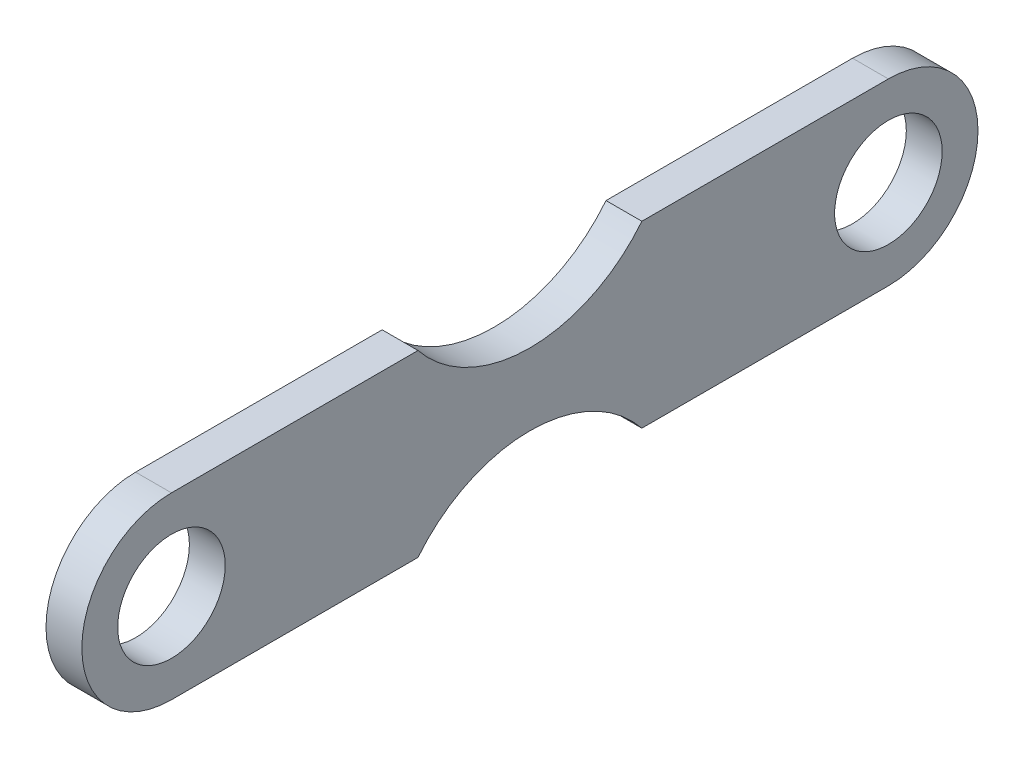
from build123d import *

# Parameters (mm, degrees)
SKETCH1_R           = 15
BOSS_EXTRUDE1_DEPTH = 10


with BuildPart() as part:
    # Sketch1 → Boss-Extrude1 (new body)
    with BuildSketch(Plane(origin=(0, 0, 0), x_dir=(0, 0, -1), z_dir=(1, 0, 0))):
        with BuildLine():
            Line((100, -25), (31.224989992, -25))
            ThreePointArc((31.224989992, -25), (0, -10), (-31.224989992, -25))
            Line((-31.224989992, -25), (-100, -25))
            ThreePointArc((-100, -25), (-125, 0), (-100, 25))
            Line((-100, 25), (-31.224989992, 25))
            ThreePointArc((-31.224989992, 25), (0, 10), (31.224989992, 25))
            Line((31.224989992, 25), (100, 25))
            ThreePointArc((100, 25), (125, 0), (100, -25))
        make_face()
        with Locations((-100, 0)):
            Circle(SKETCH1_R, mode=Mode.SUBTRACT)
        with Locations((100, 0)):
            Circle(SKETCH1_R, mode=Mode.SUBTRACT)
    extrude(amount=BOSS_EXTRUDE1_DEPTH)


solid = part.part
